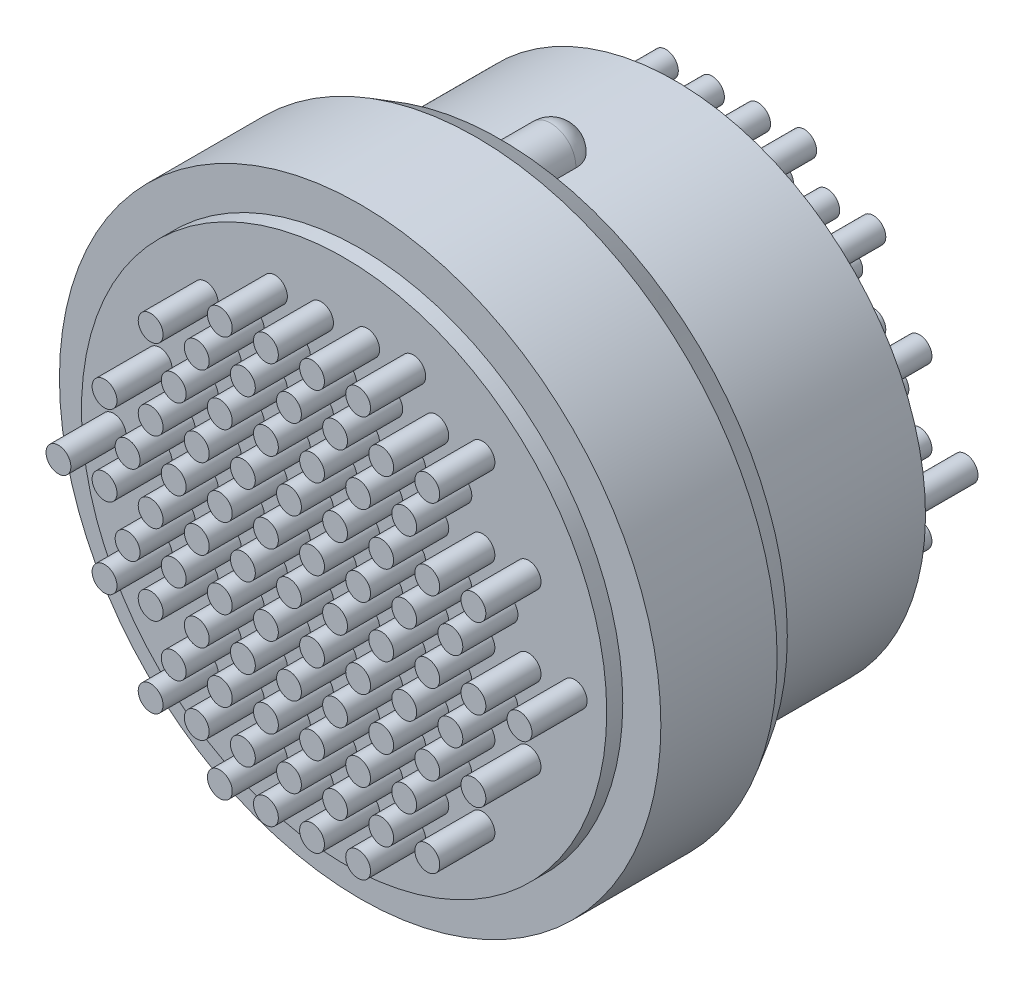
from build123d import *

# Parameters (mm, degrees)
SKETCH1_R                        = 16.637
BOSS_EXTRUDE1_DEPTH              = 1.016
SKETCH2_R                        = 19.05
BOSS_EXTRUDE3_DEPTH              = 8.89
SKETCH3_R                        = 15.875
BOSS_EXTRUDE4_DEPTH              = 11.049
CHAMFER1_SIZE                    = 1.524
CHAMFER1_SIZE2                   = 0.87988181
SKETCH4_R                        = 1.5875
KEY_DEPTH                        = 3.1877
PIN_START                        = -24.4475
SKETCH5_R                        = 0.7874
PIN_DEPTH                        = 28.2575
LPATTERN1_COUNT                  = 6
LPATTERN1_PITCH                  = 2.921
LPATTERN1_COL_COUNT              = 6
LPATTERN1_COL_PITCH              = 2.921
BOSS_EXTRUDE7_REACH              = 38.38
SKETCH6_R                        = 0.7874
BOSS_EXTRUDE7_DIRECTION_2_DEPTH  = 24.4475
LPATTERN5_COUNT                  = 4
LPATTERN5_PITCH                  = 2.921
LPATTERN5_COL_COUNT              = 5
LPATTERN5_COL_PITCH              = 2.921
BOSS_EXTRUDE8_REACH              = 38.38
SKETCH7_R                        = 0.7874
BOSS_EXTRUDE8_DIRECTION_2_DEPTH  = 24.4475
LPATTERN6_COUNT                  = 5
LPATTERN6_PITCH                  = 2.921
LPATTERN6_COL_COUNT              = 5
LPATTERN6_COL_PITCH              = 2.921
BOSS_EXTRUDE9_REACH              = 38.38
SKETCH8_R                        = 0.7874
BOSS_EXTRUDE9_DIRECTION_2_DEPTH  = 24.4475
LPATTERN7_COUNT                  = 3
LPATTERN7_PITCH                  = 2.921
LPATTERN7_COL_COUNT              = 4
LPATTERN7_COL_PITCH              = 2.921
BOSS_EXTRUDE10_REACH             = 38.38
SKETCH9_R                        = 0.7874
BOSS_EXTRUDE10_DIRECTION_2_DEPTH = 24.4475
LPATTERN8_COUNT                  = 4
LPATTERN8_PITCH                  = 2.921
LPATTERN8_COL_COUNT              = 4
LPATTERN8_COL_PITCH              = 2.921
BOSS_EXTRUDE11_REACH             = 38.38
SKETCH10_R                       = 0.7874
BOSS_EXTRUDE11_DIRECTION_2_DEPTH = 24.4475
LPATTERN9_COUNT                  = 2
LPATTERN9_PITCH                  = 2.921
LPATTERN9_COL_COUNT              = 3
LPATTERN9_COL_PITCH              = 2.921


with BuildPart() as part:
    # Sketch1 → Boss-Extrude1 (new body)
    with BuildSketch(Plane.XY):
        Circle(SKETCH1_R)
    extrude(amount=-BOSS_EXTRUDE1_DEPTH)

    # Sketch2 → Boss-Extrude3 (add)
    with BuildSketch(Plane(origin=(0, 0, -1.016), x_dir=(-1, 0, 0), z_dir=(0, 0, -1))):
        with Locations(Location((0, 0, 0), (0, 0, 180))):
            Circle(SKETCH2_R)
    extrude(amount=BOSS_EXTRUDE3_DEPTH)

    # Sketch3 → Boss-Extrude4 (add)
    with BuildSketch(Plane(origin=(0, 0, -9.906), x_dir=(-1, 0, 0), z_dir=(0, 0, -1))):
        with Locations(Location((0, 0, 0), (0, 0, 180))):
            Circle(SKETCH3_R)
    extrude(amount=BOSS_EXTRUDE4_DEPTH)

    # Chamfer1
    chamfer1_edges = [part.edges().sort_by_distance(p)[0] for p in [
        (-19.05, 0, -9.906),
    ]]
    chamfer1_side = [part.faces().sort_by_distance(p)[0] for p in [
        (-19.05, 0, -5.461),
    ]]
    chamfer(chamfer1_edges, length=CHAMFER1_SIZE, length2=CHAMFER1_SIZE2, reference=chamfer1_side[0])

    # Sketch4 → Key (add)
    with BuildSketch(Plane(origin=(0, 0, -9.906), x_dir=(-1, 0, 0), z_dir=(0, 0, -1))):
        with Locations((0, 15.875)):
            Circle(SKETCH4_R)
    extrude(amount=KEY_DEPTH)

    # Sketch11 → Revolve1 (revolve)
    with BuildSketch(Plane(origin=(0, 0, -13.0937), x_dir=(-1, 0, 0), z_dir=(0, 0, -1))):
        with BuildLine():
            Line((0, 17.4625), (0, 15.875))
            ThreePointArc((0, 15.875), (0.79375, 15.855143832), (1.585514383, 15.795625))
            ThreePointArc((1.585514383, 15.795625), (1.150253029, 16.96910887), (0, 17.4625))
        make_face()
    revolve(axis=Axis((0, 17.4625, -13.0937), (0, 1, 0)))

    # Sketch5 → Pin (add)
    with BuildSketch(Plane(origin=(0, 0, -20.955), x_dir=(-1, 0, 0), z_dir=(0, 0, -1)).offset(PIN_START)):
        Circle(SKETCH5_R)
    pin = extrude(amount=PIN_DEPTH)

    # LPattern1: Pin ×6
    with Locations(*[(-i * LPATTERN1_PITCH, 0, 0) for i in range(1, LPATTERN1_COUNT)]):
        add(pin)

    # LPattern1 col: Pin ×6
    with Locations(*[(i * LPATTERN1_COL_PITCH, 0, 0) for i in range(1, LPATTERN1_COL_COUNT)]):
        add(pin)

    # Boss-Extrude7: up to this face of the body (flat: up to its plane)
    boss_extrude7_end = Plane(part.part.faces().sort_by_distance((0, 0, -24.765))[0])
    # Sketch6 → Boss-Extrude7 (add, up to the picked face)
    with BuildSketch(Plane(origin=(0, 0, -20.955), x_dir=(-1, 0, 0), z_dir=(0, 0, -1)), mode=Mode.PRIVATE) as boss_extrude7_sk1:
        with Locations((1.4605, 2.529660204)):
            Circle(SKETCH6_R)
    boss_extrude7_tool1 = split(extrude(boss_extrude7_sk1.sketch, amount=BOSS_EXTRUDE7_REACH, mode=Mode.PRIVATE), bisect_by=boss_extrude7_end, keep=Keep.BOTH, mode=Mode.PRIVATE)
    # Sketch6 → Boss-Extrude7 (add, up to the picked face)
    with BuildSketch(Plane(origin=(0, 0, -20.955), x_dir=(-1, 0, 0), z_dir=(0, 0, -1)), mode=Mode.PRIVATE) as boss_extrude7_sk2:
        with Locations((1.4605, -2.529660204)):
            Circle(SKETCH6_R)
    boss_extrude7_tool2 = split(extrude(boss_extrude7_sk2.sketch, amount=BOSS_EXTRUDE7_REACH, mode=Mode.PRIVATE), bisect_by=boss_extrude7_end, keep=Keep.BOTH, mode=Mode.PRIVATE)
    boss_extrude7_1 = boss_extrude7_tool1.solids().sort_by(Axis((-1.4605, 2.52966, -20.955), (0, 0, -1)))[0]
    add(boss_extrude7_1)
    boss_extrude7_2 = boss_extrude7_tool2.solids().sort_by(Axis((-1.4605, -2.52966, -20.955), (0, 0, -1)))[0]
    add(boss_extrude7_2)
    boss_extrude7 = boss_extrude7_1 + boss_extrude7_2  # Boss-Extrude7 as one shape, for the pattern or mirror that repeats it

    # Sketch6 → Boss-Extrude7 direction 2 (add)
    with BuildSketch(Plane(origin=(0, 0, -20.955), x_dir=(-1, 0, 0), z_dir=(0, 0, -1))):
        with Locations((1.4605, 2.529660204)):
            Circle(SKETCH6_R)
        with Locations((1.4605, -2.529660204)):
            Circle(SKETCH6_R)
    boss_extrude7_direction_2 = extrude(amount=-BOSS_EXTRUDE7_DIRECTION_2_DEPTH)

    # LPattern5: Boss-Extrude7, Boss-Extrude7 direction 2 ×4
    with Locations(*[(-i * LPATTERN5_PITCH, 0, 0) for i in range(1, LPATTERN5_COUNT)]):
        add(boss_extrude7)
        add(boss_extrude7_direction_2)

    # LPattern5 col: Boss-Extrude7, Boss-Extrude7 direction 2 ×5
    with Locations(*[(i * LPATTERN5_COL_PITCH, 0, 0) for i in range(1, LPATTERN5_COL_COUNT)]):
        add(boss_extrude7)
        add(boss_extrude7_direction_2)

    # Boss-Extrude8: up to this face of the body (flat: up to its plane)
    boss_extrude8_end = Plane(part.part.faces().sort_by_distance((-1.4605, 2.529660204, -24.765))[0])
    # Sketch7 → Boss-Extrude8 (add, up to the picked face)
    with BuildSketch(Plane(origin=(0, 0, -20.955), x_dir=(-1, 0, 0), z_dir=(0, 0, -1)), mode=Mode.PRIVATE) as boss_extrude8_sk1:
        with Locations((0, 5.08)):
            Circle(SKETCH7_R)
    boss_extrude8_tool1 = split(extrude(boss_extrude8_sk1.sketch, amount=BOSS_EXTRUDE8_REACH, mode=Mode.PRIVATE), bisect_by=boss_extrude8_end, keep=Keep.BOTH, mode=Mode.PRIVATE)
    # Sketch7 → Boss-Extrude8 (add, up to the picked face)
    with BuildSketch(Plane(origin=(0, 0, -20.955), x_dir=(-1, 0, 0), z_dir=(0, 0, -1)), mode=Mode.PRIVATE) as boss_extrude8_sk2:
        with Locations((0, -5.08)):
            Circle(SKETCH7_R)
    boss_extrude8_tool2 = split(extrude(boss_extrude8_sk2.sketch, amount=BOSS_EXTRUDE8_REACH, mode=Mode.PRIVATE), bisect_by=boss_extrude8_end, keep=Keep.BOTH, mode=Mode.PRIVATE)
    boss_extrude8_1 = boss_extrude8_tool1.solids().sort_by(Axis((0, 5.08, -20.955), (0, 0, -1)))[0]
    add(boss_extrude8_1)
    boss_extrude8_2 = boss_extrude8_tool2.solids().sort_by(Axis((0, -5.08, -20.955), (0, 0, -1)))[0]
    add(boss_extrude8_2)
    boss_extrude8 = boss_extrude8_1 + boss_extrude8_2  # Boss-Extrude8 as one shape, for the pattern or mirror that repeats it

    # Sketch7 → Boss-Extrude8 direction 2 (add)
    with BuildSketch(Plane(origin=(0, 0, -20.955), x_dir=(-1, 0, 0), z_dir=(0, 0, -1))):
        with Locations((0, 5.08)):
            Circle(SKETCH7_R)
        with Locations((0, -5.08)):
            Circle(SKETCH7_R)
    boss_extrude8_direction_2 = extrude(amount=-BOSS_EXTRUDE8_DIRECTION_2_DEPTH)

    # LPattern6: Boss-Extrude8, Boss-Extrude8 direction 2 ×5
    with Locations(*[(-i * LPATTERN6_PITCH, 0, 0) for i in range(1, LPATTERN6_COUNT)]):
        add(boss_extrude8)
        add(boss_extrude8_direction_2)

    # LPattern6 col: Boss-Extrude8, Boss-Extrude8 direction 2 ×5
    with Locations(*[(i * LPATTERN6_COL_PITCH, 0, 0) for i in range(1, LPATTERN6_COL_COUNT)]):
        add(boss_extrude8)
        add(boss_extrude8_direction_2)

    # Boss-Extrude9: up to this face of the body (flat: up to its plane)
    boss_extrude9_end = Plane(part.part.faces().sort_by_distance((-1.4605, 2.529660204, -24.765))[0])
    # Sketch8 → Boss-Extrude9 (add, up to the picked face)
    with BuildSketch(Plane(origin=(0, 0, -20.955), x_dir=(-1, 0, 0), z_dir=(0, 0, -1)), mode=Mode.PRIVATE) as boss_extrude9_sk1:
        with Locations((1.4605, 7.62)):
            Circle(SKETCH8_R)
    boss_extrude9_tool1 = split(extrude(boss_extrude9_sk1.sketch, amount=BOSS_EXTRUDE9_REACH, mode=Mode.PRIVATE), bisect_by=boss_extrude9_end, keep=Keep.BOTH, mode=Mode.PRIVATE)
    # Sketch8 → Boss-Extrude9 (add, up to the picked face)
    with BuildSketch(Plane(origin=(0, 0, -20.955), x_dir=(-1, 0, 0), z_dir=(0, 0, -1)), mode=Mode.PRIVATE) as boss_extrude9_sk2:
        with Locations((1.4605, -7.62)):
            Circle(SKETCH8_R)
    boss_extrude9_tool2 = split(extrude(boss_extrude9_sk2.sketch, amount=BOSS_EXTRUDE9_REACH, mode=Mode.PRIVATE), bisect_by=boss_extrude9_end, keep=Keep.BOTH, mode=Mode.PRIVATE)
    boss_extrude9_1 = boss_extrude9_tool1.solids().sort_by(Axis((-1.4605, 7.62, -20.955), (0, 0, -1)))[0]
    add(boss_extrude9_1)
    boss_extrude9_2 = boss_extrude9_tool2.solids().sort_by(Axis((-1.4605, -7.62, -20.955), (0, 0, -1)))[0]
    add(boss_extrude9_2)
    boss_extrude9 = boss_extrude9_1 + boss_extrude9_2  # Boss-Extrude9 as one shape, for the pattern or mirror that repeats it

    # Sketch8 → Boss-Extrude9 direction 2 (add)
    with BuildSketch(Plane(origin=(0, 0, -20.955), x_dir=(-1, 0, 0), z_dir=(0, 0, -1))):
        with Locations((1.4605, 7.62)):
            Circle(SKETCH8_R)
        with Locations((1.4605, -7.62)):
            Circle(SKETCH8_R)
    boss_extrude9_direction_2 = extrude(amount=-BOSS_EXTRUDE9_DIRECTION_2_DEPTH)

    # LPattern7: Boss-Extrude9, Boss-Extrude9 direction 2 ×3
    with Locations(*[(-i * LPATTERN7_PITCH, 0, 0) for i in range(1, LPATTERN7_COUNT)]):
        add(boss_extrude9)
        add(boss_extrude9_direction_2)

    # LPattern7 col: Boss-Extrude9, Boss-Extrude9 direction 2 ×4
    with Locations(*[(i * LPATTERN7_COL_PITCH, 0, 0) for i in range(1, LPATTERN7_COL_COUNT)]):
        add(boss_extrude9)
        add(boss_extrude9_direction_2)

    # Boss-Extrude10: up to this face of the body (flat: up to its plane)
    boss_extrude10_end = Plane(part.part.faces().sort_by_distance((-1.4605, -2.529660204, -24.765))[0])
    # Sketch9 → Boss-Extrude10 (add, up to the picked face)
    with BuildSketch(Plane(origin=(0, 0, -20.955), x_dir=(-1, 0, 0), z_dir=(0, 0, -1)), mode=Mode.PRIVATE) as boss_extrude10_sk1:
        with Locations((0, 10.16)):
            Circle(SKETCH9_R)
    boss_extrude10_tool1 = split(extrude(boss_extrude10_sk1.sketch, amount=BOSS_EXTRUDE10_REACH, mode=Mode.PRIVATE), bisect_by=boss_extrude10_end, keep=Keep.BOTH, mode=Mode.PRIVATE)
    # Sketch9 → Boss-Extrude10 (add, up to the picked face)
    with BuildSketch(Plane(origin=(0, 0, -20.955), x_dir=(-1, 0, 0), z_dir=(0, 0, -1)), mode=Mode.PRIVATE) as boss_extrude10_sk2:
        with Locations((0, -10.16)):
            Circle(SKETCH9_R)
    boss_extrude10_tool2 = split(extrude(boss_extrude10_sk2.sketch, amount=BOSS_EXTRUDE10_REACH, mode=Mode.PRIVATE), bisect_by=boss_extrude10_end, keep=Keep.BOTH, mode=Mode.PRIVATE)
    boss_extrude10_1 = boss_extrude10_tool1.solids().sort_by(Axis((0, 10.16, -20.955), (0, 0, -1)))[0]
    add(boss_extrude10_1)
    boss_extrude10_2 = boss_extrude10_tool2.solids().sort_by(Axis((0, -10.16, -20.955), (0, 0, -1)))[0]
    add(boss_extrude10_2)
    boss_extrude10 = boss_extrude10_1 + boss_extrude10_2  # Boss-Extrude10 as one shape, for the pattern or mirror that repeats it

    # Sketch9 → Boss-Extrude10 direction 2 (add)
    with BuildSketch(Plane(origin=(0, 0, -20.955), x_dir=(-1, 0, 0), z_dir=(0, 0, -1))):
        with Locations((0, 10.16)):
            Circle(SKETCH9_R)
        with Locations((0, -10.16)):
            Circle(SKETCH9_R)
    boss_extrude10_direction_2 = extrude(amount=-BOSS_EXTRUDE10_DIRECTION_2_DEPTH)

    # LPattern8: Boss-Extrude10, Boss-Extrude10 direction 2 ×4
    with Locations(*[(-i * LPATTERN8_PITCH, 0, 0) for i in range(1, LPATTERN8_COUNT)]):
        add(boss_extrude10)
        add(boss_extrude10_direction_2)

    # LPattern8 col: Boss-Extrude10, Boss-Extrude10 direction 2 ×4
    with Locations(*[(i * LPATTERN8_COL_PITCH, 0, 0) for i in range(1, LPATTERN8_COL_COUNT)]):
        add(boss_extrude10)
        add(boss_extrude10_direction_2)

    # Boss-Extrude11: up to this face of the body (flat: up to its plane)
    boss_extrude11_end = Plane(part.part.faces().sort_by_distance((-2.921, 0, -24.765))[0])
    # Sketch10 → Boss-Extrude11 (add, up to the picked face)
    with BuildSketch(Plane(origin=(0, 0, -20.955), x_dir=(-1, 0, 0), z_dir=(0, 0, -1)), mode=Mode.PRIVATE) as boss_extrude11_sk1:
        with Locations((1.4605, 12.7)):
            Circle(SKETCH10_R)
    boss_extrude11_tool1 = split(extrude(boss_extrude11_sk1.sketch, amount=BOSS_EXTRUDE11_REACH, mode=Mode.PRIVATE), bisect_by=boss_extrude11_end, keep=Keep.BOTH, mode=Mode.PRIVATE)
    # Sketch10 → Boss-Extrude11 (add, up to the picked face)
    with BuildSketch(Plane(origin=(0, 0, -20.955), x_dir=(-1, 0, 0), z_dir=(0, 0, -1)), mode=Mode.PRIVATE) as boss_extrude11_sk2:
        with Locations((1.4605, -12.7)):
            Circle(SKETCH10_R)
    boss_extrude11_tool2 = split(extrude(boss_extrude11_sk2.sketch, amount=BOSS_EXTRUDE11_REACH, mode=Mode.PRIVATE), bisect_by=boss_extrude11_end, keep=Keep.BOTH, mode=Mode.PRIVATE)
    boss_extrude11_1 = boss_extrude11_tool1.solids().sort_by(Axis((-1.4605, 12.7, -20.955), (0, 0, -1)))[0]
    add(boss_extrude11_1)
    boss_extrude11_2 = boss_extrude11_tool2.solids().sort_by(Axis((-1.4605, -12.7, -20.955), (0, 0, -1)))[0]
    add(boss_extrude11_2)
    boss_extrude11 = boss_extrude11_1 + boss_extrude11_2  # Boss-Extrude11 as one shape, for the pattern or mirror that repeats it

    # Sketch10 → Boss-Extrude11 direction 2 (add)
    with BuildSketch(Plane(origin=(0, 0, -20.955), x_dir=(-1, 0, 0), z_dir=(0, 0, -1))):
        with Locations((1.4605, 12.7)):
            Circle(SKETCH10_R)
        with Locations((1.4605, -12.7)):
            Circle(SKETCH10_R)
    boss_extrude11_direction_2 = extrude(amount=-BOSS_EXTRUDE11_DIRECTION_2_DEPTH)

    # LPattern9: Boss-Extrude11, Boss-Extrude11 direction 2 ×2
    with Locations(*[(-i * LPATTERN9_PITCH, 0, 0) for i in range(1, LPATTERN9_COUNT)]):
        add(boss_extrude11)
        add(boss_extrude11_direction_2)

    # LPattern9 col: Boss-Extrude11, Boss-Extrude11 direction 2 ×3
    with Locations(*[(i * LPATTERN9_COL_PITCH, 0, 0) for i in range(1, LPATTERN9_COL_COUNT)]):
        add(boss_extrude11)
        add(boss_extrude11_direction_2)


solid = part.part
